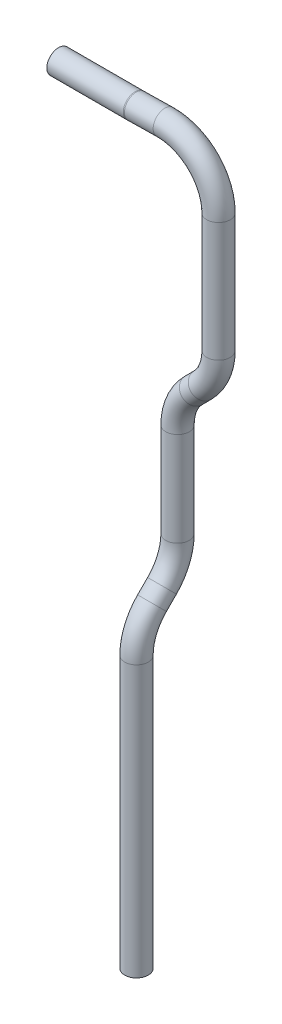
ISO-10303-21;
HEADER;
FILE_DESCRIPTION(('STEP AP214'),'2;1');
FILE_NAME('part.step','',(''),(''),'','','');
FILE_SCHEMA(('AUTOMOTIVE_DESIGN { 1 0 10303 214 1 1 1 1 }'));
ENDSEC;
DATA;
#1=APPLICATION_CONTEXT('core data for automotive mechanical design processes');
#2=APPLICATION_PROTOCOL_DEFINITION('international standard','automotive_design',2000,#1);
#3=PRODUCT_CONTEXT('',#1,'mechanical');
#4=PRODUCT('Part','Part','',(#3));
#5=PRODUCT_RELATED_PRODUCT_CATEGORY('part','',(#4));
#6=PRODUCT_DEFINITION_FORMATION('','',#4);
#7=PRODUCT_DEFINITION_CONTEXT('part definition',#1,'design');
#8=PRODUCT_DEFINITION('design','',#6,#7);
#9=PRODUCT_DEFINITION_SHAPE('','',#8);
#10=(LENGTH_UNIT() NAMED_UNIT(*) SI_UNIT(.MILLI.,.METRE.));
#11=(NAMED_UNIT(*) PLANE_ANGLE_UNIT() SI_UNIT($,.RADIAN.));
#12=(NAMED_UNIT(*) SI_UNIT($,.STERADIAN.) SOLID_ANGLE_UNIT());
#13=UNCERTAINTY_MEASURE_WITH_UNIT(LENGTH_MEASURE(1.E-05),#10,'distance_accuracy_value','');
#14=(GEOMETRIC_REPRESENTATION_CONTEXT(3) GLOBAL_UNCERTAINTY_ASSIGNED_CONTEXT((#13)) GLOBAL_UNIT_ASSIGNED_CONTEXT((#10,
#11,#12)) REPRESENTATION_CONTEXT('',''));
#15=CARTESIAN_POINT('',(0.,0.,0.));
#16=DIRECTION('',(0.,0.,1.));
#17=DIRECTION('',(1.,0.,0.));
#18=AXIS2_PLACEMENT_3D('',#15,#16,#17);
#19=CARTESIAN_POINT('',(32.1045300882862,-117.309528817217,11.0744));
#20=DIRECTION('',(0.,-1.,0.));
#21=DIRECTION('',(0.,0.,-1.));
#22=AXIS2_PLACEMENT_3D('',#19,#20,#21);
#23=CYLINDRICAL_SURFACE('',#22,3.175);
#24=CARTESIAN_POINT('',(32.1045300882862,-117.309528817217,11.0744));
#25=DIRECTION('',(0.,-1.,0.));
#26=DIRECTION('',(-0.0174524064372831,0.,-0.999847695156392));
#27=AXIS2_PLACEMENT_3D('',#24,#25,#26);
#28=CIRCLE('',#27,3.175);
#29=CARTESIAN_POINT('',(32.1045300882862,-117.309528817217,14.2494));
#30=VERTEX_POINT('',#29);
#31=EDGE_CURVE('E44',#30,#30,#28,.T.);
#32=ORIENTED_EDGE('',*,*,#31,.T.);
#33=EDGE_LOOP('',(#32));
#34=FACE_BOUND('',#33,.T.);
#35=CARTESIAN_POINT('',(32.1045300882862,-190.5,11.0744));
#36=DIRECTION('',(0.,-1.,0.));
#37=DIRECTION('',(-0.0174524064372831,0.,-0.999847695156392));
#38=AXIS2_PLACEMENT_3D('',#35,#36,#37);
#39=CIRCLE('',#38,3.175);
#40=CARTESIAN_POINT('',(32.0491186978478,-190.5,7.89988356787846));
#41=VERTEX_POINT('',#40);
#42=EDGE_CURVE('E10',#41,#41,#39,.T.);
#43=ORIENTED_EDGE('',*,*,#42,.F.);
#44=EDGE_LOOP('',(#43));
#45=FACE_BOUND('',#44,.T.);
#46=ADVANCED_FACE('F34',(#34,#45),#23,.T.);
#47=CARTESIAN_POINT('',(32.1045300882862,-117.309528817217,11.0744));
#48=DIRECTION('',(0.,-1.,0.));
#49=DIRECTION('',(0.,0.,-1.));
#50=AXIS2_PLACEMENT_3D('',#47,#48,#49);
#51=CYLINDRICAL_SURFACE('',#50,2.54);
#52=CARTESIAN_POINT('',(32.1045300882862,-117.309528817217,11.0744));
#53=DIRECTION('',(0.,-1.,0.));
#54=DIRECTION('',(-0.0174524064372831,0.,-0.999847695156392));
#55=AXIS2_PLACEMENT_3D('',#52,#53,#54);
#56=CIRCLE('',#55,2.54);
#57=CARTESIAN_POINT('',(32.1045300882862,-117.309528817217,13.6144));
#58=VERTEX_POINT('',#57);
#59=EDGE_CURVE('E48',#58,#58,#56,.T.);
#60=ORIENTED_EDGE('',*,*,#59,.F.);
#61=EDGE_LOOP('',(#60));
#62=FACE_BOUND('',#61,.T.);
#63=CARTESIAN_POINT('',(32.1045300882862,-190.5,11.0744));
#64=DIRECTION('',(0.,-1.,0.));
#65=DIRECTION('',(-0.0174524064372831,0.,-0.999847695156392));
#66=AXIS2_PLACEMENT_3D('',#63,#64,#65);
#67=CIRCLE('',#66,2.54);
#68=CARTESIAN_POINT('',(32.0602009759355,-190.5,8.53478685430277));
#69=VERTEX_POINT('',#68);
#70=EDGE_CURVE('E40',#69,#69,#67,.T.);
#71=ORIENTED_EDGE('',*,*,#70,.T.);
#72=EDGE_LOOP('',(#71));
#73=FACE_BOUND('',#72,.T.);
#74=ADVANCED_FACE('F206',(#62,#73),#51,.F.);
#75=CARTESIAN_POINT('',(32.1045300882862,-117.309528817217,-3.21310000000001));
#76=DIRECTION('',(1.,0.,0.));
#77=DIRECTION('',(0.,0.,-1.));
#78=AXIS2_PLACEMENT_3D('',#75,#76,#77);
#79=TOROIDAL_SURFACE('',#78,14.2875,3.175);
#80=CARTESIAN_POINT('',(32.1045300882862,-107.206740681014,6.88968813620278));
#81=DIRECTION('',(0.,-0.707106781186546,0.70710678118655));
#82=DIRECTION('',(-0.0174524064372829,-0.706999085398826,-0.706999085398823));
#83=AXIS2_PLACEMENT_3D('',#80,#81,#82);
#84=CIRCLE('',#83,3.175);
#85=CARTESIAN_POINT('',(32.1045300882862,-104.961676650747,9.13475216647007));
#86=VERTEX_POINT('',#85);
#87=EDGE_CURVE('E53',#86,#86,#84,.T.);
#88=CARTESIAN_POINT('',(32.1045300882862,-117.309528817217,-3.21310000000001));
#89=DIRECTION('',(1.,0.,0.));
#90=DIRECTION('',(0.,0.,-1.));
#91=AXIS2_PLACEMENT_3D('',#88,#89,#90);
#92=CIRCLE('',#91,17.4625);
#93=EDGE_CURVE('',#86,#30,#92,.T.);
#94=ORIENTED_EDGE('',*,*,#87,.T.);
#95=ORIENTED_EDGE('',*,*,#31,.F.);
#96=ORIENTED_EDGE('',*,*,#93,.T.);
#97=ORIENTED_EDGE('',*,*,#93,.F.);
#98=EDGE_LOOP('',(#94,#96,#95,#97));
#99=FACE_BOUND('',#98,.T.);
#100=ADVANCED_FACE('F202',(#99),#79,.T.);
#101=CARTESIAN_POINT('',(32.1045300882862,-117.309528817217,-3.21310000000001));
#102=DIRECTION('',(1.,0.,0.));
#103=DIRECTION('',(0.,0.,-1.));
#104=AXIS2_PLACEMENT_3D('',#101,#102,#103);
#105=TOROIDAL_SURFACE('',#104,14.2875,2.54);
#106=CARTESIAN_POINT('',(32.1045300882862,-107.206740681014,6.88968813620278));
#107=DIRECTION('',(0.,-0.707106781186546,0.70710678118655));
#108=DIRECTION('',(-0.0174524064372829,-0.706999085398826,-0.706999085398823));
#109=AXIS2_PLACEMENT_3D('',#106,#107,#108);
#110=CIRCLE('',#109,2.54);
#111=CARTESIAN_POINT('',(32.1045300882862,-105.4106894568,8.68573936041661));
#112=VERTEX_POINT('',#111);
#113=EDGE_CURVE('E56',#112,#112,#110,.T.);
#114=CARTESIAN_POINT('',(32.1045300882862,-117.309528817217,-3.21310000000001));
#115=DIRECTION('',(1.,0.,0.));
#116=DIRECTION('',(0.,0.,-1.));
#117=AXIS2_PLACEMENT_3D('',#114,#115,#116);
#118=CIRCLE('',#117,16.8275);
#119=EDGE_CURVE('',#112,#58,#118,.T.);
#120=ORIENTED_EDGE('',*,*,#113,.F.);
#121=ORIENTED_EDGE('',*,*,#59,.T.);
#122=ORIENTED_EDGE('',*,*,#119,.T.);
#123=ORIENTED_EDGE('',*,*,#119,.F.);
#124=EDGE_LOOP('',(#120,#122,#121,#123));
#125=FACE_BOUND('',#124,.T.);
#126=ADVANCED_FACE('F199',(#125),#105,.F.);
#127=CARTESIAN_POINT('',(32.1045300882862,-104.501764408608,4.18471186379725));
#128=DIRECTION('',(0.,-0.707106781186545,0.70710678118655));
#129=DIRECTION('',(0.,-0.70710678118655,-0.707106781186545));
#130=AXIS2_PLACEMENT_3D('',#127,#128,#129);
#131=CYLINDRICAL_SURFACE('',#130,3.175);
#132=CARTESIAN_POINT('',(32.1045300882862,-104.501764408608,4.18471186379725));
#133=DIRECTION('',(0.,-0.707106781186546,0.70710678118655));
#134=DIRECTION('',(-0.0174524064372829,-0.706999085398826,-0.706999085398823));
#135=AXIS2_PLACEMENT_3D('',#132,#133,#134);
#136=CIRCLE('',#135,3.175);
#137=CARTESIAN_POINT('',(32.1045300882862,-106.746828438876,1.93964783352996));
#138=VERTEX_POINT('',#137);
#139=EDGE_CURVE('E59',#138,#138,#136,.T.);
#140=ORIENTED_EDGE('',*,*,#139,.T.);
#141=EDGE_LOOP('',(#140));
#142=FACE_BOUND('',#141,.T.);
#143=ORIENTED_EDGE('',*,*,#87,.F.);
#144=EDGE_LOOP('',(#143));
#145=FACE_BOUND('',#144,.T.);
#146=ADVANCED_FACE('F195',(#142,#145),#131,.T.);
#147=CARTESIAN_POINT('',(32.1045300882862,-104.501764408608,4.18471186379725));
#148=DIRECTION('',(0.,-0.707106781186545,0.70710678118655));
#149=DIRECTION('',(0.,-0.70710678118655,-0.707106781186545));
#150=AXIS2_PLACEMENT_3D('',#147,#148,#149);
#151=CYLINDRICAL_SURFACE('',#150,2.54);
#152=CARTESIAN_POINT('',(32.1045300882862,-104.501764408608,4.18471186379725));
#153=DIRECTION('',(0.,-0.707106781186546,0.70710678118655));
#154=DIRECTION('',(-0.0174524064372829,-0.706999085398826,-0.706999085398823));
#155=AXIS2_PLACEMENT_3D('',#152,#153,#154);
#156=CIRCLE('',#155,2.54);
#157=CARTESIAN_POINT('',(32.1045300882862,-106.297815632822,2.38866063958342));
#158=VERTEX_POINT('',#157);
#159=EDGE_CURVE('E62',#158,#158,#156,.T.);
#160=ORIENTED_EDGE('',*,*,#159,.F.);
#161=EDGE_LOOP('',(#160));
#162=FACE_BOUND('',#161,.T.);
#163=ORIENTED_EDGE('',*,*,#113,.T.);
#164=EDGE_LOOP('',(#163));
#165=FACE_BOUND('',#164,.T.);
#166=ADVANCED_FACE('F192',(#162,#165),#151,.F.);
#167=CARTESIAN_POINT('',(32.1045300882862,-94.3989762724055,14.2875));
#168=DIRECTION('',(-1.,0.,0.));
#169=DIRECTION('',(0.,0.,1.));
#170=AXIS2_PLACEMENT_3D('',#167,#168,#169);
#171=TOROIDAL_SURFACE('',#170,14.2875,3.175);
#172=CARTESIAN_POINT('',(32.1045300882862,-94.3989762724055,0.));
#173=DIRECTION('',(0.,-1.,0.));
#174=DIRECTION('',(-0.017452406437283,0.,-0.999847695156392));
#175=AXIS2_PLACEMENT_3D('',#172,#173,#174);
#176=CIRCLE('',#175,3.175);
#177=CARTESIAN_POINT('',(32.1045300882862,-94.3989762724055,-3.17499999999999));
#178=VERTEX_POINT('',#177);
#179=EDGE_CURVE('E65',#178,#178,#176,.T.);
#180=CARTESIAN_POINT('',(32.1045300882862,-94.3989762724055,14.2875));
#181=DIRECTION('',(-1.,0.,0.));
#182=DIRECTION('',(0.,0.,1.));
#183=AXIS2_PLACEMENT_3D('',#180,#181,#182);
#184=CIRCLE('',#183,17.4625);
#185=EDGE_CURVE('',#178,#138,#184,.T.);
#186=ORIENTED_EDGE('',*,*,#179,.T.);
#187=ORIENTED_EDGE('',*,*,#139,.F.);
#188=ORIENTED_EDGE('',*,*,#185,.T.);
#189=ORIENTED_EDGE('',*,*,#185,.F.);
#190=EDGE_LOOP('',(#186,#188,#187,#189));
#191=FACE_BOUND('',#190,.T.);
#192=ADVANCED_FACE('F188',(#191),#171,.T.);
#193=CARTESIAN_POINT('',(32.1045300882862,-94.3989762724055,14.2875));
#194=DIRECTION('',(-1.,0.,0.));
#195=DIRECTION('',(0.,0.,1.));
#196=AXIS2_PLACEMENT_3D('',#193,#194,#195);
#197=TOROIDAL_SURFACE('',#196,14.2875,2.54);
#198=CARTESIAN_POINT('',(32.1045300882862,-94.3989762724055,0.));
#199=DIRECTION('',(0.,-1.,0.));
#200=DIRECTION('',(-0.017452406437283,0.,-0.999847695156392));
#201=AXIS2_PLACEMENT_3D('',#198,#199,#200);
#202=CIRCLE('',#201,2.54);
#203=CARTESIAN_POINT('',(32.1045300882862,-94.3989762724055,-2.53999999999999));
#204=VERTEX_POINT('',#203);
#205=EDGE_CURVE('E68',#204,#204,#202,.T.);
#206=CARTESIAN_POINT('',(32.1045300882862,-94.3989762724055,14.2875));
#207=DIRECTION('',(-1.,0.,0.));
#208=DIRECTION('',(0.,0.,1.));
#209=AXIS2_PLACEMENT_3D('',#206,#207,#208);
#210=CIRCLE('',#209,16.8275);
#211=EDGE_CURVE('',#204,#158,#210,.T.);
#212=ORIENTED_EDGE('',*,*,#205,.F.);
#213=ORIENTED_EDGE('',*,*,#159,.T.);
#214=ORIENTED_EDGE('',*,*,#211,.T.);
#215=ORIENTED_EDGE('',*,*,#211,.F.);
#216=EDGE_LOOP('',(#212,#214,#213,#215));
#217=FACE_BOUND('',#216,.T.);
#218=ADVANCED_FACE('F185',(#217),#197,.F.);
#219=CARTESIAN_POINT('',(32.1045300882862,-68.9989762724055,0.));
#220=DIRECTION('',(0.,-1.,0.));
#221=DIRECTION('',(0.,0.,-1.));
#222=AXIS2_PLACEMENT_3D('',#219,#220,#221);
#223=CYLINDRICAL_SURFACE('',#222,3.175);
#224=CARTESIAN_POINT('',(32.1045300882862,-68.9989762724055,0.));
#225=DIRECTION('',(0.,-1.,0.));
#226=DIRECTION('',(-0.017452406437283,0.,-0.999847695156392));
#227=AXIS2_PLACEMENT_3D('',#224,#225,#226);
#228=CIRCLE('',#227,3.175);
#229=CARTESIAN_POINT('',(28.9315833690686,-68.9989762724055,0.114167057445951));
#230=VERTEX_POINT('',#229);
#231=EDGE_CURVE('E71',#230,#230,#228,.T.);
#232=ORIENTED_EDGE('',*,*,#231,.T.);
#233=EDGE_LOOP('',(#232));
#234=FACE_BOUND('',#233,.T.);
#235=ORIENTED_EDGE('',*,*,#179,.F.);
#236=EDGE_LOOP('',(#235));
#237=FACE_BOUND('',#236,.T.);
#238=ADVANCED_FACE('F181',(#234,#237),#223,.T.);
#239=CARTESIAN_POINT('',(32.1045300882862,-68.9989762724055,0.));
#240=DIRECTION('',(0.,-1.,0.));
#241=DIRECTION('',(0.,0.,-1.));
#242=AXIS2_PLACEMENT_3D('',#239,#240,#241);
#243=CYLINDRICAL_SURFACE('',#242,2.54);
#244=CARTESIAN_POINT('',(32.1045300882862,-68.9989762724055,0.));
#245=DIRECTION('',(0.,-1.,0.));
#246=DIRECTION('',(-0.017452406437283,0.,-0.999847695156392));
#247=AXIS2_PLACEMENT_3D('',#244,#245,#246);
#248=CIRCLE('',#247,2.54);
#249=CARTESIAN_POINT('',(29.5661727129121,-68.9989762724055,0.0913336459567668));
#250=VERTEX_POINT('',#249);
#251=EDGE_CURVE('E74',#250,#250,#248,.T.);
#252=ORIENTED_EDGE('',*,*,#251,.F.);
#253=EDGE_LOOP('',(#252));
#254=FACE_BOUND('',#253,.T.);
#255=ORIENTED_EDGE('',*,*,#205,.T.);
#256=EDGE_LOOP('',(#255));
#257=FACE_BOUND('',#256,.T.);
#258=ADVANCED_FACE('F178',(#254,#257),#243,.F.);
#259=CARTESIAN_POINT('',(46.3827903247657,-68.9989762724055,-0.513751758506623));
#260=DIRECTION('',(0.0359581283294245,0.,0.99935329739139));
#261=DIRECTION('',(0.99935329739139,0.,-0.0359581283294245));
#262=AXIS2_PLACEMENT_3D('',#259,#260,#261);
#263=TOROIDAL_SURFACE('',#262,14.2875,3.175);
#264=CARTESIAN_POINT('',(36.2865356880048,-58.8961881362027,-0.150474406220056));
#265=DIRECTION('',(-0.70664949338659,-0.707106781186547,0.0254262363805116));
#266=DIRECTION('',(-0.0228708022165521,-0.0130896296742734,-0.999652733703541));
#267=AXIS2_PLACEMENT_3D('',#264,#265,#266);
#268=CIRCLE('',#267,3.175);
#269=CARTESIAN_POINT('',(34.0429235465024,-56.6511241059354,-0.0697461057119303));
#270=VERTEX_POINT('',#269);
#271=EDGE_CURVE('E77',#270,#270,#268,.T.);
#272=CARTESIAN_POINT('',(46.3827903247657,-68.9989762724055,-0.513751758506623));
#273=DIRECTION('',(0.0359581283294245,0.,0.99935329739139));
#274=DIRECTION('',(0.99935329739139,0.,-0.0359581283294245));
#275=AXIS2_PLACEMENT_3D('',#272,#273,#274);
#276=CIRCLE('',#275,17.4625);
#277=EDGE_CURVE('',#270,#230,#276,.T.);
#278=ORIENTED_EDGE('',*,*,#271,.T.);
#279=ORIENTED_EDGE('',*,*,#231,.F.);
#280=ORIENTED_EDGE('',*,*,#277,.T.);
#281=ORIENTED_EDGE('',*,*,#277,.F.);
#282=EDGE_LOOP('',(#278,#280,#279,#281));
#283=FACE_BOUND('',#282,.T.);
#284=ADVANCED_FACE('F174',(#283),#263,.T.);
#285=CARTESIAN_POINT('',(46.3827903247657,-68.9989762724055,-0.513751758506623));
#286=DIRECTION('',(0.0359581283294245,0.,0.99935329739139));
#287=DIRECTION('',(0.99935329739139,0.,-0.0359581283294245));
#288=AXIS2_PLACEMENT_3D('',#285,#286,#287);
#289=TOROIDAL_SURFACE('',#288,14.2875,2.54);
#290=CARTESIAN_POINT('',(36.2865356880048,-58.8961881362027,-0.150474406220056));
#291=DIRECTION('',(-0.70664949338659,-0.707106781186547,0.0254262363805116));
#292=DIRECTION('',(-0.0228708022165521,-0.0130896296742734,-0.999652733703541));
#293=AXIS2_PLACEMENT_3D('',#290,#291,#292);
#294=CIRCLE('',#293,2.54);
#295=CARTESIAN_POINT('',(34.4916459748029,-57.1001369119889,-0.0858917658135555));
#296=VERTEX_POINT('',#295);
#297=EDGE_CURVE('E80',#296,#296,#294,.T.);
#298=CARTESIAN_POINT('',(46.3827903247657,-68.9989762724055,-0.513751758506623));
#299=DIRECTION('',(0.0359581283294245,0.,0.99935329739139));
#300=DIRECTION('',(0.99935329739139,0.,-0.0359581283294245));
#301=AXIS2_PLACEMENT_3D('',#298,#299,#300);
#302=CIRCLE('',#301,16.8275);
#303=EDGE_CURVE('',#296,#250,#302,.T.);
#304=ORIENTED_EDGE('',*,*,#297,.F.);
#305=ORIENTED_EDGE('',*,*,#251,.T.);
#306=ORIENTED_EDGE('',*,*,#303,.T.);
#307=ORIENTED_EDGE('',*,*,#303,.F.);
#308=EDGE_LOOP('',(#304,#306,#305,#307));
#309=FACE_BOUND('',#308,.T.);
#310=ADVANCED_FACE('F171',(#309),#289,.F.);
#311=CARTESIAN_POINT('',(38.6090090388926,-56.5722118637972,-0.234040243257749));
#312=DIRECTION('',(-0.706649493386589,-0.707106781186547,0.0254262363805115));
#313=DIRECTION('',(0.707335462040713,-0.706878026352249,0.));
#314=AXIS2_PLACEMENT_3D('',#311,#312,#313);
#315=CYLINDRICAL_SURFACE('',#314,3.175);
#316=CARTESIAN_POINT('',(38.6090090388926,-56.5722118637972,-0.234040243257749));
#317=DIRECTION('',(-0.70664949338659,-0.707106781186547,0.0254262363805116));
#318=DIRECTION('',(-0.0228708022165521,-0.0130896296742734,-0.999652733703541));
#319=AXIS2_PLACEMENT_3D('',#316,#317,#318);
#320=CIRCLE('',#319,3.175);
#321=CARTESIAN_POINT('',(40.8526211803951,-58.8172758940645,-0.314768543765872));
#322=VERTEX_POINT('',#321);
#323=EDGE_CURVE('E83',#322,#322,#320,.T.);
#324=ORIENTED_EDGE('',*,*,#323,.T.);
#325=EDGE_LOOP('',(#324));
#326=FACE_BOUND('',#325,.T.);
#327=ORIENTED_EDGE('',*,*,#271,.F.);
#328=EDGE_LOOP('',(#327));
#329=FACE_BOUND('',#328,.T.);
#330=ADVANCED_FACE('F167',(#326,#329),#315,.T.);
#331=CARTESIAN_POINT('',(38.6090090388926,-56.5722118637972,-0.234040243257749));
#332=DIRECTION('',(-0.706649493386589,-0.707106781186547,0.0254262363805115));
#333=DIRECTION('',(0.707335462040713,-0.706878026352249,0.));
#334=AXIS2_PLACEMENT_3D('',#331,#332,#333);
#335=CYLINDRICAL_SURFACE('',#334,2.54);
#336=CARTESIAN_POINT('',(38.6090090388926,-56.5722118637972,-0.234040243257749));
#337=DIRECTION('',(-0.70664949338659,-0.707106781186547,0.0254262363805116));
#338=DIRECTION('',(-0.0228708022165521,-0.0130896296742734,-0.999652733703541));
#339=AXIS2_PLACEMENT_3D('',#336,#337,#338);
#340=CIRCLE('',#339,2.54);
#341=CARTESIAN_POINT('',(40.4038987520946,-58.368263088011,-0.298622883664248));
#342=VERTEX_POINT('',#341);
#343=EDGE_CURVE('E86',#342,#342,#340,.T.);
#344=ORIENTED_EDGE('',*,*,#343,.F.);
#345=EDGE_LOOP('',(#344));
#346=FACE_BOUND('',#345,.T.);
#347=ORIENTED_EDGE('',*,*,#297,.T.);
#348=EDGE_LOOP('',(#347));
#349=FACE_BOUND('',#348,.T.);
#350=ADVANCED_FACE('F164',(#346,#349),#335,.F.);
#351=CARTESIAN_POINT('',(28.5127544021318,-46.4694237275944,0.129237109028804));
#352=DIRECTION('',(-0.0359581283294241,0.,-0.99935329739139));
#353=DIRECTION('',(-0.99935329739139,0.,0.0359581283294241));
#354=AXIS2_PLACEMENT_3D('',#351,#352,#353);
#355=TOROIDAL_SURFACE('',#354,14.2875,3.175);
#356=CARTESIAN_POINT('',(42.7910146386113,-46.4694237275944,-0.384514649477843));
#357=DIRECTION('',(0.,-1.,0.));
#358=DIRECTION('',(-0.0174524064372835,0.,-0.999847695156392));
#359=AXIS2_PLACEMENT_3D('',#356,#357,#358);
#360=CIRCLE('',#359,3.175);
#361=CARTESIAN_POINT('',(45.9639613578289,-46.4694237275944,-0.498681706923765));
#362=VERTEX_POINT('',#361);
#363=EDGE_CURVE('E89',#362,#362,#360,.T.);
#364=CARTESIAN_POINT('',(28.5127544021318,-46.4694237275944,0.129237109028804));
#365=DIRECTION('',(-0.0359581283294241,0.,-0.99935329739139));
#366=DIRECTION('',(-0.99935329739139,0.,0.0359581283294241));
#367=AXIS2_PLACEMENT_3D('',#364,#365,#366);
#368=CIRCLE('',#367,17.4625);
#369=EDGE_CURVE('',#362,#322,#368,.T.);
#370=ORIENTED_EDGE('',*,*,#363,.T.);
#371=ORIENTED_EDGE('',*,*,#323,.F.);
#372=ORIENTED_EDGE('',*,*,#369,.T.);
#373=ORIENTED_EDGE('',*,*,#369,.F.);
#374=EDGE_LOOP('',(#370,#372,#371,#373));
#375=FACE_BOUND('',#374,.T.);
#376=ADVANCED_FACE('F160',(#375),#355,.T.);
#377=CARTESIAN_POINT('',(28.5127544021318,-46.4694237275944,0.129237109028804));
#378=DIRECTION('',(-0.0359581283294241,0.,-0.99935329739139));
#379=DIRECTION('',(-0.99935329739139,0.,0.0359581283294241));
#380=AXIS2_PLACEMENT_3D('',#377,#378,#379);
#381=TOROIDAL_SURFACE('',#380,14.2875,2.54);
#382=CARTESIAN_POINT('',(42.7910146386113,-46.4694237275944,-0.384514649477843));
#383=DIRECTION('',(0.,-1.,0.));
#384=DIRECTION('',(-0.0174524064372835,0.,-0.999847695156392));
#385=AXIS2_PLACEMENT_3D('',#382,#383,#384);
#386=CIRCLE('',#385,2.54);
#387=CARTESIAN_POINT('',(45.3293720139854,-46.4694237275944,-0.47584829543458));
#388=VERTEX_POINT('',#387);
#389=EDGE_CURVE('E92',#388,#388,#386,.T.);
#390=CARTESIAN_POINT('',(28.5127544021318,-46.4694237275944,0.129237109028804));
#391=DIRECTION('',(-0.0359581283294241,0.,-0.99935329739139));
#392=DIRECTION('',(-0.99935329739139,0.,0.0359581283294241));
#393=AXIS2_PLACEMENT_3D('',#390,#391,#392);
#394=CIRCLE('',#393,16.8275);
#395=EDGE_CURVE('',#388,#342,#394,.T.);
#396=ORIENTED_EDGE('',*,*,#389,.F.);
#397=ORIENTED_EDGE('',*,*,#343,.T.);
#398=ORIENTED_EDGE('',*,*,#395,.T.);
#399=ORIENTED_EDGE('',*,*,#395,.F.);
#400=EDGE_LOOP('',(#396,#398,#397,#399));
#401=FACE_BOUND('',#400,.T.);
#402=ADVANCED_FACE('F157',(#401),#381,.F.);
#403=CARTESIAN_POINT('',(42.7910146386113,-14.2875,-0.384514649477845));
#404=DIRECTION('',(0.,-1.,0.));
#405=DIRECTION('',(1.,0.,0.));
#406=AXIS2_PLACEMENT_3D('',#403,#404,#405);
#407=CYLINDRICAL_SURFACE('',#406,3.175);
#408=CARTESIAN_POINT('',(42.7910146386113,-14.2875,-0.384514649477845));
#409=DIRECTION('',(0.,-1.,0.));
#410=DIRECTION('',(-0.0174524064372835,0.,-0.999847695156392));
#411=AXIS2_PLACEMENT_3D('',#408,#409,#410);
#412=CIRCLE('',#411,3.175);
#413=CARTESIAN_POINT('',(45.9655310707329,-14.2875,-0.43992603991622));
#414=VERTEX_POINT('',#413);
#415=EDGE_CURVE('E95',#414,#414,#412,.T.);
#416=ORIENTED_EDGE('',*,*,#415,.T.);
#417=EDGE_LOOP('',(#416));
#418=FACE_BOUND('',#417,.T.);
#419=ORIENTED_EDGE('',*,*,#363,.F.);
#420=EDGE_LOOP('',(#419));
#421=FACE_BOUND('',#420,.T.);
#422=ADVANCED_FACE('F153',(#418,#421),#407,.T.);
#423=CARTESIAN_POINT('',(42.7910146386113,-14.2875,-0.384514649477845));
#424=DIRECTION('',(0.,-1.,0.));
#425=DIRECTION('',(1.,0.,0.));
#426=AXIS2_PLACEMENT_3D('',#423,#424,#425);
#427=CYLINDRICAL_SURFACE('',#426,2.54);
#428=CARTESIAN_POINT('',(42.7910146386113,-14.2875,-0.384514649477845));
#429=DIRECTION('',(0.,-1.,0.));
#430=DIRECTION('',(-0.0174524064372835,0.,-0.999847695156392));
#431=AXIS2_PLACEMENT_3D('',#428,#429,#430);
#432=CIRCLE('',#431,2.54);
#433=CARTESIAN_POINT('',(45.3306277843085,-14.2875,-0.428843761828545));
#434=VERTEX_POINT('',#433);
#435=EDGE_CURVE('E98',#434,#434,#432,.T.);
#436=ORIENTED_EDGE('',*,*,#435,.F.);
#437=EDGE_LOOP('',(#436));
#438=FACE_BOUND('',#437,.T.);
#439=ORIENTED_EDGE('',*,*,#389,.T.);
#440=EDGE_LOOP('',(#439));
#441=FACE_BOUND('',#440,.T.);
#442=ADVANCED_FACE('F150',(#438,#441),#427,.F.);
#443=CARTESIAN_POINT('',(28.5056906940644,-14.2875,-0.135163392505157));
#444=DIRECTION('',(-0.0174524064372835,0.,-0.999847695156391));
#445=DIRECTION('',(-0.999847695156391,0.,0.0174524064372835));
#446=AXIS2_PLACEMENT_3D('',#443,#444,#445);
#447=TOROIDAL_SURFACE('',#446,14.2875,3.175);
#448=CARTESIAN_POINT('',(28.5056906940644,0.,-0.135163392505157));
#449=DIRECTION('',(0.999847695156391,0.,-0.0174524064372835));
#450=DIRECTION('',(-0.0174524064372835,0.,-0.999847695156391));
#451=AXIS2_PLACEMENT_3D('',#448,#449,#450);
#452=CIRCLE('',#451,3.175);
#453=CARTESIAN_POINT('',(28.5056906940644,3.17500000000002,-0.135163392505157));
#454=VERTEX_POINT('',#453);
#455=EDGE_CURVE('E101',#454,#454,#452,.T.);
#456=CARTESIAN_POINT('',(28.5056906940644,-14.2875,-0.135163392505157));
#457=DIRECTION('',(-0.0174524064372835,0.,-0.999847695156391));
#458=DIRECTION('',(-0.999847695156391,0.,0.0174524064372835));
#459=AXIS2_PLACEMENT_3D('',#456,#457,#458);
#460=CIRCLE('',#459,17.4625);
#461=EDGE_CURVE('',#454,#414,#460,.T.);
#462=ORIENTED_EDGE('',*,*,#455,.T.);
#463=ORIENTED_EDGE('',*,*,#415,.F.);
#464=ORIENTED_EDGE('',*,*,#461,.T.);
#465=ORIENTED_EDGE('',*,*,#461,.F.);
#466=EDGE_LOOP('',(#462,#464,#463,#465));
#467=FACE_BOUND('',#466,.T.);
#468=ADVANCED_FACE('F146',(#467),#447,.T.);
#469=CARTESIAN_POINT('',(28.5056906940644,-14.2875,-0.135163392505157));
#470=DIRECTION('',(-0.0174524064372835,0.,-0.999847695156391));
#471=DIRECTION('',(-0.999847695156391,0.,0.0174524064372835));
#472=AXIS2_PLACEMENT_3D('',#469,#470,#471);
#473=TOROIDAL_SURFACE('',#472,14.2875,2.54);
#474=CARTESIAN_POINT('',(28.5056906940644,0.,-0.135163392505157));
#475=DIRECTION('',(0.999847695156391,0.,-0.0174524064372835));
#476=DIRECTION('',(-0.0174524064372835,0.,-0.999847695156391));
#477=AXIS2_PLACEMENT_3D('',#474,#475,#476);
#478=CIRCLE('',#477,2.54);
#479=CARTESIAN_POINT('',(28.5056906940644,2.54000000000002,-0.135163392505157));
#480=VERTEX_POINT('',#479);
#481=EDGE_CURVE('E104',#480,#480,#478,.T.);
#482=CARTESIAN_POINT('',(28.5056906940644,-14.2875,-0.135163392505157));
#483=DIRECTION('',(-0.0174524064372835,0.,-0.999847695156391));
#484=DIRECTION('',(-0.999847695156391,0.,0.0174524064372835));
#485=AXIS2_PLACEMENT_3D('',#482,#483,#484);
#486=CIRCLE('',#485,16.8275);
#487=EDGE_CURVE('',#480,#434,#486,.T.);
#488=ORIENTED_EDGE('',*,*,#481,.F.);
#489=ORIENTED_EDGE('',*,*,#435,.T.);
#490=ORIENTED_EDGE('',*,*,#487,.T.);
#491=ORIENTED_EDGE('',*,*,#487,.F.);
#492=EDGE_LOOP('',(#488,#490,#489,#491));
#493=FACE_BOUND('',#492,.T.);
#494=ADVANCED_FACE('F143',(#493),#473,.F.);
#495=CARTESIAN_POINT('',(20.8868512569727,0.,-0.00217605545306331));
#496=DIRECTION('',(0.999847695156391,0.,-0.0174524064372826));
#497=DIRECTION('',(-0.0174524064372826,0.,-0.999847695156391));
#498=AXIS2_PLACEMENT_3D('',#495,#496,#497);
#499=CYLINDRICAL_SURFACE('',#498,3.175);
#500=CARTESIAN_POINT('',(20.8868512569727,0.,-0.00217605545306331));
#501=DIRECTION('',(0.999847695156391,0.,-0.0174524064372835));
#502=DIRECTION('',(-0.0174524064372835,0.,-0.999847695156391));
#503=AXIS2_PLACEMENT_3D('',#500,#501,#502);
#504=CIRCLE('',#503,3.175);
#505=CARTESIAN_POINT('',(20.9422626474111,0.,3.17234037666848));
#506=VERTEX_POINT('',#505);
#507=EDGE_CURVE('E107',#506,#506,#504,.T.);
#508=ORIENTED_EDGE('',*,*,#507,.T.);
#509=EDGE_LOOP('',(#508));
#510=FACE_BOUND('',#509,.T.);
#511=ORIENTED_EDGE('',*,*,#455,.F.);
#512=EDGE_LOOP('',(#511));
#513=FACE_BOUND('',#512,.T.);
#514=ADVANCED_FACE('F139',(#510,#513),#499,.T.);
#515=CARTESIAN_POINT('',(20.8868512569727,0.,-0.00217605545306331));
#516=DIRECTION('',(0.999847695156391,0.,-0.0174524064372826));
#517=DIRECTION('',(-0.0174524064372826,0.,-0.999847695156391));
#518=AXIS2_PLACEMENT_3D('',#515,#516,#517);
#519=CYLINDRICAL_SURFACE('',#518,2.54);
#520=CARTESIAN_POINT('',(20.8868512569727,0.,-0.00217605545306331));
#521=DIRECTION('',(0.999847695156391,0.,-0.0174524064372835));
#522=DIRECTION('',(-0.0174524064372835,0.,-0.999847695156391));
#523=AXIS2_PLACEMENT_3D('',#520,#521,#522);
#524=CIRCLE('',#523,2.54);
#525=CARTESIAN_POINT('',(20.9311803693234,0.,2.53743709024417));
#526=VERTEX_POINT('',#525);
#527=EDGE_CURVE('E110',#526,#526,#524,.T.);
#528=ORIENTED_EDGE('',*,*,#527,.F.);
#529=EDGE_LOOP('',(#528));
#530=FACE_BOUND('',#529,.T.);
#531=ORIENTED_EDGE('',*,*,#481,.T.);
#532=EDGE_LOOP('',(#531));
#533=FACE_BOUND('',#532,.T.);
#534=ADVANCED_FACE('F136',(#530,#533),#519,.F.);
#535=CARTESIAN_POINT('',(20.6375,0.,-14.2875));
#536=DIRECTION('',(0.,1.,0.));
#537=DIRECTION('',(0.,0.,1.));
#538=AXIS2_PLACEMENT_3D('',#535,#536,#537);
#539=TOROIDAL_SURFACE('',#538,14.2875,3.175);
#540=CARTESIAN_POINT('',(20.6375,0.,0.));
#541=DIRECTION('',(1.,0.,0.));
#542=DIRECTION('',(0.,0.,-1.));
#543=AXIS2_PLACEMENT_3D('',#540,#541,#542);
#544=CIRCLE('',#543,3.175);
#545=CARTESIAN_POINT('',(20.6375,0.,3.175));
#546=VERTEX_POINT('',#545);
#547=EDGE_CURVE('E113',#546,#546,#544,.T.);
#548=CARTESIAN_POINT('',(20.6375,0.,-14.2875));
#549=DIRECTION('',(0.,1.,0.));
#550=DIRECTION('',(0.,0.,1.));
#551=AXIS2_PLACEMENT_3D('',#548,#549,#550);
#552=CIRCLE('',#551,17.4625);
#553=EDGE_CURVE('',#546,#506,#552,.T.);
#554=ORIENTED_EDGE('',*,*,#547,.T.);
#555=ORIENTED_EDGE('',*,*,#507,.F.);
#556=ORIENTED_EDGE('',*,*,#553,.T.);
#557=ORIENTED_EDGE('',*,*,#553,.F.);
#558=EDGE_LOOP('',(#554,#556,#555,#557));
#559=FACE_BOUND('',#558,.T.);
#560=ADVANCED_FACE('F132',(#559),#539,.T.);
#561=CARTESIAN_POINT('',(20.6375,0.,-14.2875));
#562=DIRECTION('',(0.,1.,0.));
#563=DIRECTION('',(0.,0.,1.));
#564=AXIS2_PLACEMENT_3D('',#561,#562,#563);
#565=TOROIDAL_SURFACE('',#564,14.2875,2.54);
#566=CARTESIAN_POINT('',(20.6375,0.,0.));
#567=DIRECTION('',(1.,0.,0.));
#568=DIRECTION('',(0.,0.,-1.));
#569=AXIS2_PLACEMENT_3D('',#566,#567,#568);
#570=CIRCLE('',#569,2.54);
#571=CARTESIAN_POINT('',(20.6375,0.,2.54));
#572=VERTEX_POINT('',#571);
#573=EDGE_CURVE('E117',#572,#572,#570,.T.);
#574=CARTESIAN_POINT('',(20.6375,0.,-14.2875));
#575=DIRECTION('',(0.,1.,0.));
#576=DIRECTION('',(0.,0.,1.));
#577=AXIS2_PLACEMENT_3D('',#574,#575,#576);
#578=CIRCLE('',#577,16.8275);
#579=EDGE_CURVE('',#572,#526,#578,.T.);
#580=ORIENTED_EDGE('',*,*,#573,.F.);
#581=ORIENTED_EDGE('',*,*,#527,.T.);
#582=ORIENTED_EDGE('',*,*,#579,.T.);
#583=ORIENTED_EDGE('',*,*,#579,.F.);
#584=EDGE_LOOP('',(#580,#582,#581,#583));
#585=FACE_BOUND('',#584,.T.);
#586=ADVANCED_FACE('F129',(#585),#565,.F.);
#587=CARTESIAN_POINT('',(20.6375,0.,0.));
#588=DIRECTION('',(-1.,0.,0.));
#589=DIRECTION('',(0.,0.,1.));
#590=AXIS2_PLACEMENT_3D('',#587,#588,#589);
#591=CYLINDRICAL_SURFACE('',#590,2.54);
#592=CARTESIAN_POINT('',(0.,0.,0.));
#593=DIRECTION('',(1.,0.,0.));
#594=DIRECTION('',(0.,0.,-1.));
#595=AXIS2_PLACEMENT_3D('',#592,#593,#594);
#596=CIRCLE('',#595,2.54);
#597=CARTESIAN_POINT('',(0.,0.,2.54));
#598=VERTEX_POINT('',#597);
#599=EDGE_CURVE('E118',#598,#598,#596,.T.);
#600=CARTESIAN_POINT('',(20.6375,0.,2.54));
#601=CARTESIAN_POINT('',(20.4225260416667,0.,2.54));
#602=CARTESIAN_POINT('',(20.2075520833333,0.,2.54));
#603=CARTESIAN_POINT('',(19.7776041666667,0.,2.54));
#604=CARTESIAN_POINT('',(19.5626302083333,0.,2.54));
#605=CARTESIAN_POINT('',(19.1326822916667,0.,2.54));
#606=CARTESIAN_POINT('',(18.9177083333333,0.,2.54));
#607=CARTESIAN_POINT('',(18.4877604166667,0.,2.54));
#608=CARTESIAN_POINT('',(18.2727864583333,0.,2.54));
#609=CARTESIAN_POINT('',(17.8428385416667,0.,2.54));
#610=CARTESIAN_POINT('',(17.6278645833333,0.,2.54));
#611=CARTESIAN_POINT('',(17.1979166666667,0.,2.54));
#612=CARTESIAN_POINT('',(16.9829427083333,0.,2.54));
#613=CARTESIAN_POINT('',(16.5529947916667,0.,2.54));
#614=CARTESIAN_POINT('',(16.3380208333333,0.,2.54));
#615=CARTESIAN_POINT('',(15.9080729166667,0.,2.54));
#616=CARTESIAN_POINT('',(15.6930989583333,0.,2.54));
#617=CARTESIAN_POINT('',(15.2631510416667,0.,2.54));
#618=CARTESIAN_POINT('',(15.0481770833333,0.,2.54));
#619=CARTESIAN_POINT('',(14.6182291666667,0.,2.54));
#620=CARTESIAN_POINT('',(14.4032552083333,0.,2.54));
#621=CARTESIAN_POINT('',(13.9733072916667,0.,2.54));
#622=CARTESIAN_POINT('',(13.7583333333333,0.,2.54));
#623=CARTESIAN_POINT('',(13.3283854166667,0.,2.54));
#624=CARTESIAN_POINT('',(13.1134114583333,0.,2.54));
#625=CARTESIAN_POINT('',(12.6834635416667,0.,2.54));
#626=CARTESIAN_POINT('',(12.4684895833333,0.,2.54));
#627=CARTESIAN_POINT('',(12.0385416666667,0.,2.54));
#628=CARTESIAN_POINT('',(11.8235677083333,0.,2.54));
#629=CARTESIAN_POINT('',(11.3936197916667,0.,2.54));
#630=CARTESIAN_POINT('',(11.1786458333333,0.,2.54));
#631=CARTESIAN_POINT('',(10.7486979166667,0.,2.54));
#632=CARTESIAN_POINT('',(10.5337239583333,0.,2.54));
#633=CARTESIAN_POINT('',(10.1037760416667,0.,2.54));
#634=CARTESIAN_POINT('',(9.88880208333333,0.,2.54));
#635=CARTESIAN_POINT('',(9.45885416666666,0.,2.54));
#636=CARTESIAN_POINT('',(9.24388020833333,0.,2.54));
#637=CARTESIAN_POINT('',(8.81393229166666,0.,2.54));
#638=CARTESIAN_POINT('',(8.59895833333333,0.,2.54));
#639=CARTESIAN_POINT('',(8.16901041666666,0.,2.54));
#640=CARTESIAN_POINT('',(7.95403645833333,0.,2.54));
#641=CARTESIAN_POINT('',(7.52408854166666,0.,2.54));
#642=CARTESIAN_POINT('',(7.30911458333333,0.,2.54));
#643=CARTESIAN_POINT('',(6.87916666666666,0.,2.54));
#644=CARTESIAN_POINT('',(6.66419270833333,0.,2.54));
#645=CARTESIAN_POINT('',(6.23424479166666,0.,2.54));
#646=CARTESIAN_POINT('',(6.01927083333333,0.,2.54));
#647=CARTESIAN_POINT('',(5.58932291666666,0.,2.54));
#648=CARTESIAN_POINT('',(5.37434895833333,0.,2.54));
#649=CARTESIAN_POINT('',(4.94440104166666,0.,2.54));
#650=CARTESIAN_POINT('',(4.72942708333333,0.,2.54));
#651=CARTESIAN_POINT('',(4.29947916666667,0.,2.54));
#652=CARTESIAN_POINT('',(4.08450520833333,0.,2.54));
#653=CARTESIAN_POINT('',(3.65455729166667,0.,2.54));
#654=CARTESIAN_POINT('',(3.43958333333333,0.,2.54));
#655=CARTESIAN_POINT('',(3.00963541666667,0.,2.54));
#656=CARTESIAN_POINT('',(2.79466145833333,0.,2.54));
#657=CARTESIAN_POINT('',(2.36471354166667,0.,2.54));
#658=CARTESIAN_POINT('',(2.14973958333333,0.,2.54));
#659=CARTESIAN_POINT('',(1.71979166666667,0.,2.54));
#660=CARTESIAN_POINT('',(1.50481770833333,0.,2.54));
#661=CARTESIAN_POINT('',(1.07486979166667,0.,2.54));
#662=CARTESIAN_POINT('',(0.859895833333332,0.,2.54));
#663=CARTESIAN_POINT('',(0.429947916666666,0.,2.54));
#664=CARTESIAN_POINT('',(0.214973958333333,0.,2.54));
#665=CARTESIAN_POINT('',(0.,0.,2.54));
#666=B_SPLINE_CURVE_WITH_KNOTS('',3,(#600,#601,#602,#603,#604,#605,#606,#607,#608,#609,#610,
#611,#612,#613,#614,#615,#616,#617,#618,#619,#620,#621,#622,#623,#624,#625,#626,#627,#628,#629,
#630,#631,#632,#633,#634,#635,#636,#637,#638,#639,#640,#641,#642,#643,#644,#645,#646,#647,#648,
#649,#650,#651,#652,#653,#654,#655,#656,#657,#658,#659,#660,#661,#662,#663,#664,#665),
.UNSPECIFIED.,.F.,.F.,(4,2,2,2,2,2,2,2,2,2,2,2,2,2,2,2,2,2,2,2,2,2,2,2,2,2,2,2,2,2,2,2,4),(0.,
0.644921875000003,1.28984375,1.934765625,2.5796875,3.224609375,3.86953125,4.514453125,5.159375,
5.804296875,6.44921875,7.094140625,7.7390625,8.383984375,9.02890625,9.673828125,10.31875,
10.963671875,11.60859375,12.253515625,12.8984375,13.543359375,14.18828125,14.833203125,
15.478125,16.123046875,16.76796875,17.412890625,18.0578125,18.702734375,19.34765625,
19.992578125,20.6375),.UNSPECIFIED.);
#667=EDGE_CURVE('BSEAM126',#572,#598,#666,.T.);
#668=ORIENTED_EDGE('',*,*,#573,.T.);
#669=ORIENTED_EDGE('',*,*,#599,.F.);
#670=ORIENTED_EDGE('',*,*,#667,.T.);
#671=ORIENTED_EDGE('',*,*,#667,.F.);
#672=EDGE_LOOP('',(#668,#670,#669,#671));
#673=FACE_BOUND('',#672,.T.);
#674=ADVANCED_FACE('F126',(#673),#591,.F.);
#675=CARTESIAN_POINT('',(20.6375,0.,0.));
#676=DIRECTION('',(-1.,0.,0.));
#677=DIRECTION('',(0.,0.,1.));
#678=AXIS2_PLACEMENT_3D('',#675,#676,#677);
#679=CYLINDRICAL_SURFACE('',#678,3.175);
#680=CARTESIAN_POINT('',(0.,0.,0.));
#681=DIRECTION('',(1.,0.,0.));
#682=DIRECTION('',(0.,0.,-1.));
#683=AXIS2_PLACEMENT_3D('',#680,#681,#682);
#684=CIRCLE('',#683,3.175);
#685=CARTESIAN_POINT('',(0.,0.,3.175));
#686=VERTEX_POINT('',#685);
#687=EDGE_CURVE('E114',#686,#686,#684,.T.);
#688=CARTESIAN_POINT('',(20.6375,0.,3.175));
#689=CARTESIAN_POINT('',(20.4225260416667,0.,3.175));
#690=CARTESIAN_POINT('',(20.2075520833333,0.,3.175));
#691=CARTESIAN_POINT('',(19.7776041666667,0.,3.175));
#692=CARTESIAN_POINT('',(19.5626302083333,0.,3.175));
#693=CARTESIAN_POINT('',(19.1326822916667,0.,3.175));
#694=CARTESIAN_POINT('',(18.9177083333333,0.,3.175));
#695=CARTESIAN_POINT('',(18.4877604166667,0.,3.175));
#696=CARTESIAN_POINT('',(18.2727864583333,0.,3.175));
#697=CARTESIAN_POINT('',(17.8428385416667,0.,3.175));
#698=CARTESIAN_POINT('',(17.6278645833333,0.,3.175));
#699=CARTESIAN_POINT('',(17.1979166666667,0.,3.175));
#700=CARTESIAN_POINT('',(16.9829427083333,0.,3.175));
#701=CARTESIAN_POINT('',(16.5529947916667,0.,3.175));
#702=CARTESIAN_POINT('',(16.3380208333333,0.,3.175));
#703=CARTESIAN_POINT('',(15.9080729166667,0.,3.175));
#704=CARTESIAN_POINT('',(15.6930989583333,0.,3.175));
#705=CARTESIAN_POINT('',(15.2631510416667,0.,3.175));
#706=CARTESIAN_POINT('',(15.0481770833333,0.,3.175));
#707=CARTESIAN_POINT('',(14.6182291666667,0.,3.175));
#708=CARTESIAN_POINT('',(14.4032552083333,0.,3.175));
#709=CARTESIAN_POINT('',(13.9733072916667,0.,3.175));
#710=CARTESIAN_POINT('',(13.7583333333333,0.,3.175));
#711=CARTESIAN_POINT('',(13.3283854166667,0.,3.175));
#712=CARTESIAN_POINT('',(13.1134114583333,0.,3.175));
#713=CARTESIAN_POINT('',(12.6834635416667,0.,3.175));
#714=CARTESIAN_POINT('',(12.4684895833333,0.,3.175));
#715=CARTESIAN_POINT('',(12.0385416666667,0.,3.175));
#716=CARTESIAN_POINT('',(11.8235677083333,0.,3.175));
#717=CARTESIAN_POINT('',(11.3936197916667,0.,3.175));
#718=CARTESIAN_POINT('',(11.1786458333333,0.,3.175));
#719=CARTESIAN_POINT('',(10.7486979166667,0.,3.175));
#720=CARTESIAN_POINT('',(10.5337239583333,0.,3.175));
#721=CARTESIAN_POINT('',(10.1037760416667,0.,3.175));
#722=CARTESIAN_POINT('',(9.88880208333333,0.,3.175));
#723=CARTESIAN_POINT('',(9.45885416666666,0.,3.175));
#724=CARTESIAN_POINT('',(9.24388020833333,0.,3.175));
#725=CARTESIAN_POINT('',(8.81393229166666,0.,3.175));
#726=CARTESIAN_POINT('',(8.59895833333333,0.,3.175));
#727=CARTESIAN_POINT('',(8.16901041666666,0.,3.175));
#728=CARTESIAN_POINT('',(7.95403645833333,0.,3.175));
#729=CARTESIAN_POINT('',(7.52408854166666,0.,3.175));
#730=CARTESIAN_POINT('',(7.30911458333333,0.,3.175));
#731=CARTESIAN_POINT('',(6.87916666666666,0.,3.175));
#732=CARTESIAN_POINT('',(6.66419270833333,0.,3.175));
#733=CARTESIAN_POINT('',(6.23424479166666,0.,3.175));
#734=CARTESIAN_POINT('',(6.01927083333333,0.,3.175));
#735=CARTESIAN_POINT('',(5.58932291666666,0.,3.175));
#736=CARTESIAN_POINT('',(5.37434895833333,0.,3.175));
#737=CARTESIAN_POINT('',(4.94440104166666,0.,3.175));
#738=CARTESIAN_POINT('',(4.72942708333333,0.,3.175));
#739=CARTESIAN_POINT('',(4.29947916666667,0.,3.175));
#740=CARTESIAN_POINT('',(4.08450520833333,0.,3.175));
#741=CARTESIAN_POINT('',(3.65455729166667,0.,3.175));
#742=CARTESIAN_POINT('',(3.43958333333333,0.,3.175));
#743=CARTESIAN_POINT('',(3.00963541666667,0.,3.175));
#744=CARTESIAN_POINT('',(2.79466145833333,0.,3.175));
#745=CARTESIAN_POINT('',(2.36471354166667,0.,3.175));
#746=CARTESIAN_POINT('',(2.14973958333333,0.,3.175));
#747=CARTESIAN_POINT('',(1.71979166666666,0.,3.175));
#748=CARTESIAN_POINT('',(1.50481770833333,0.,3.175));
#749=CARTESIAN_POINT('',(1.07486979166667,0.,3.175));
#750=CARTESIAN_POINT('',(0.859895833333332,0.,3.175));
#751=CARTESIAN_POINT('',(0.429947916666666,0.,3.175));
#752=CARTESIAN_POINT('',(0.214973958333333,0.,3.175));
#753=CARTESIAN_POINT('',(0.,0.,3.175));
#754=B_SPLINE_CURVE_WITH_KNOTS('',3,(#688,#689,#690,#691,#692,#693,#694,#695,#696,#697,#698,
#699,#700,#701,#702,#703,#704,#705,#706,#707,#708,#709,#710,#711,#712,#713,#714,#715,#716,#717,
#718,#719,#720,#721,#722,#723,#724,#725,#726,#727,#728,#729,#730,#731,#732,#733,#734,#735,#736,
#737,#738,#739,#740,#741,#742,#743,#744,#745,#746,#747,#748,#749,#750,#751,#752,#753),
.UNSPECIFIED.,.F.,.F.,(4,2,2,2,2,2,2,2,2,2,2,2,2,2,2,2,2,2,2,2,2,2,2,2,2,2,2,2,2,2,2,2,4),(0.,
0.644921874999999,1.28984375,1.934765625,2.5796875,3.224609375,3.86953125,4.51445312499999,
5.159375,5.804296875,6.44921875,7.094140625,7.73906249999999,8.38398437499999,9.02890624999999,
9.67382812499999,10.31875,10.963671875,11.60859375,12.253515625,12.8984375,13.543359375,
14.18828125,14.833203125,15.478125,16.123046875,16.76796875,17.412890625,18.0578125,
18.702734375,19.34765625,19.992578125,20.6375),.UNSPECIFIED.);
#755=EDGE_CURVE('BSEAM248',#546,#686,#754,.T.);
#756=ORIENTED_EDGE('',*,*,#547,.F.);
#757=ORIENTED_EDGE('',*,*,#687,.T.);
#758=ORIENTED_EDGE('',*,*,#755,.T.);
#759=ORIENTED_EDGE('',*,*,#755,.F.);
#760=EDGE_LOOP('',(#756,#758,#757,#759));
#761=FACE_BOUND('',#760,.T.);
#762=ADVANCED_FACE('F248',(#761),#679,.T.);
#763=CARTESIAN_POINT('',(32.1045300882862,-190.5,11.0744));
#764=DIRECTION('',(0.,-1.,0.));
#765=DIRECTION('',(-0.0174524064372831,0.,-0.999847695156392));
#766=AXIS2_PLACEMENT_3D('',#763,#764,#765);
#767=PLANE('',#766);
#768=ORIENTED_EDGE('',*,*,#70,.F.);
#769=EDGE_LOOP('',(#768));
#770=FACE_BOUND('',#769,.T.);
#771=ORIENTED_EDGE('',*,*,#42,.T.);
#772=EDGE_LOOP('',(#771));
#773=FACE_BOUND('',#772,.T.);
#774=ADVANCED_FACE('F251',(#770,#773),#767,.T.);
#775=CARTESIAN_POINT('',(0.,0.,0.));
#776=DIRECTION('',(1.,0.,0.));
#777=DIRECTION('',(0.,0.,-1.));
#778=AXIS2_PLACEMENT_3D('',#775,#776,#777);
#779=PLANE('',#778);
#780=ORIENTED_EDGE('',*,*,#599,.T.);
#781=EDGE_LOOP('',(#780));
#782=FACE_BOUND('',#781,.T.);
#783=ORIENTED_EDGE('',*,*,#687,.F.);
#784=EDGE_LOOP('',(#783));
#785=FACE_BOUND('',#784,.T.);
#786=ADVANCED_FACE('F253',(#782,#785),#779,.F.);
#787=CLOSED_SHELL('',(#46,#74,#100,#126,#146,#166,#192,#218,#238,#258,#284,#310,#330,#350,#376,
#402,#422,#442,#468,#494,#514,#534,#560,#586,#674,#762,#774,#786));
#788=MANIFOLD_SOLID_BREP('B2',#787);
#789=ADVANCED_BREP_SHAPE_REPRESENTATION('',(#18,#788),#14);
#790=SHAPE_DEFINITION_REPRESENTATION(#9,#789);
ENDSEC;
END-ISO-10303-21;
